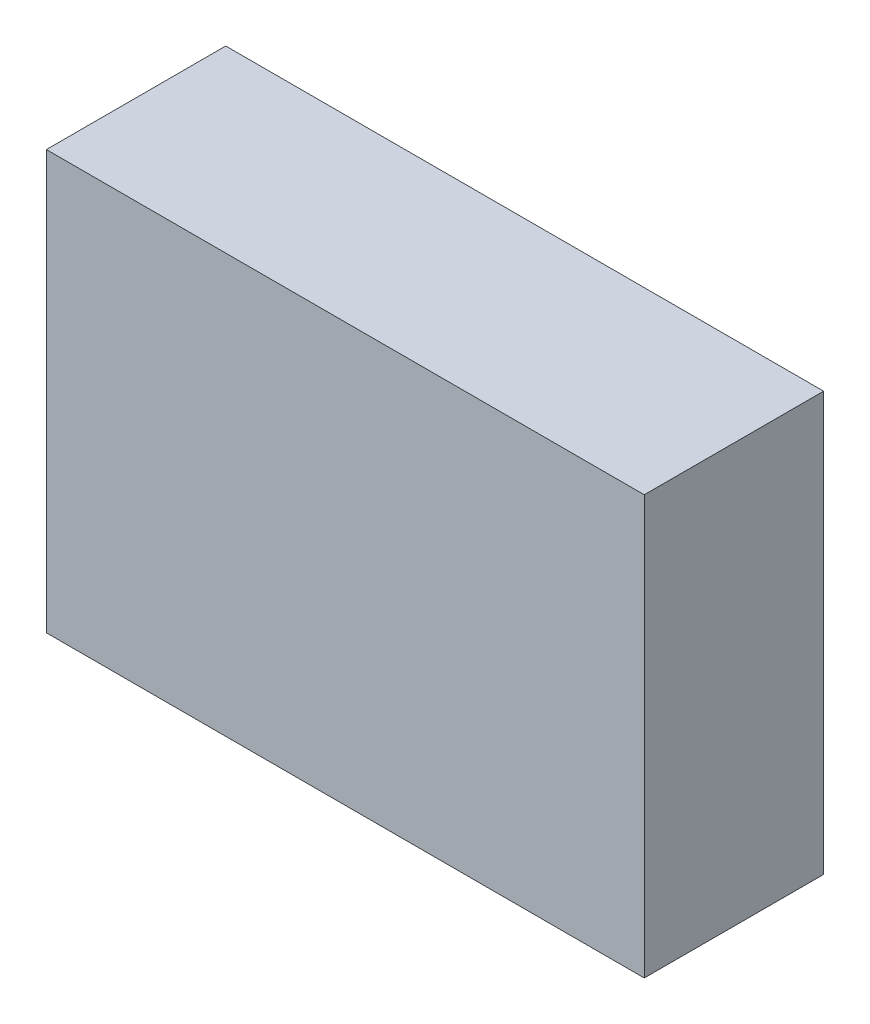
from build123d import *

# Parameters (mm, degrees)
SKETCH1_W           = 10
SKETCH1_H           = 3
BOSS_EXTRUDE1_DEPTH = 7


with BuildPart() as part:
    # Sketch1 → Boss-Extrude1 (new body)
    with BuildSketch(Plane(origin=(0, 0, 0), x_dir=(1, 0, 0), z_dir=(0, 1, 0))):
        Rectangle(SKETCH1_W, SKETCH1_H)
    extrude(amount=BOSS_EXTRUDE1_DEPTH)


solid = part.part
